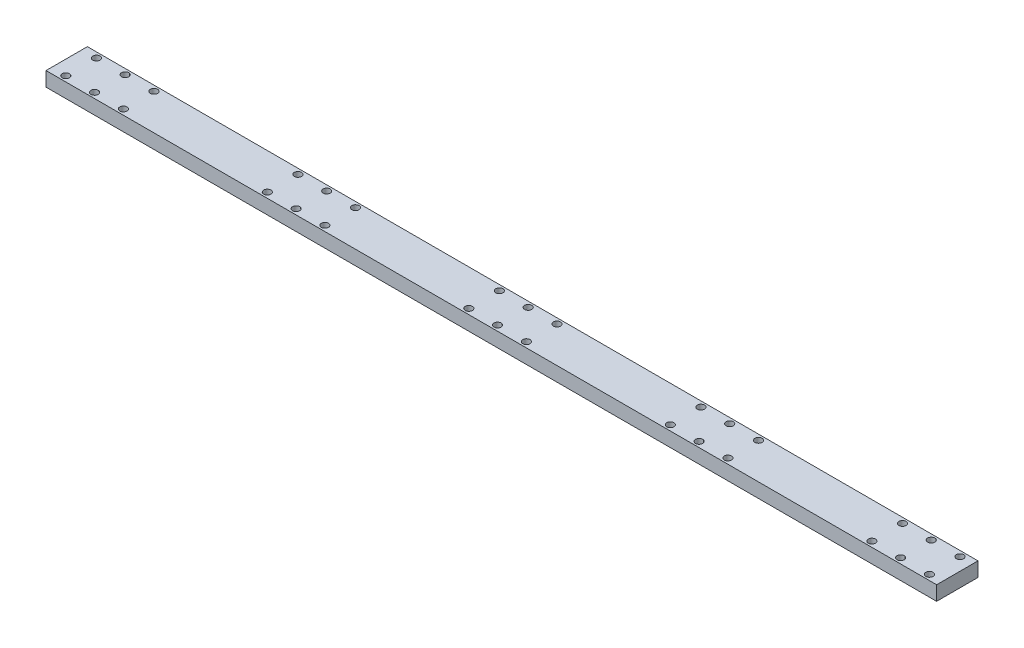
ISO-10303-21;
HEADER;
FILE_DESCRIPTION(('STEP AP214'),'2;1');
FILE_NAME('part.step','',(''),(''),'','','');
FILE_SCHEMA(('AUTOMOTIVE_DESIGN { 1 0 10303 214 1 1 1 1 }'));
ENDSEC;
DATA;
#1=APPLICATION_CONTEXT('core data for automotive mechanical design processes');
#2=APPLICATION_PROTOCOL_DEFINITION('international standard','automotive_design',2000,#1);
#3=PRODUCT_CONTEXT('',#1,'mechanical');
#4=PRODUCT('Part','Part','',(#3));
#5=PRODUCT_RELATED_PRODUCT_CATEGORY('part','',(#4));
#6=PRODUCT_DEFINITION_FORMATION('','',#4);
#7=PRODUCT_DEFINITION_CONTEXT('part definition',#1,'design');
#8=PRODUCT_DEFINITION('design','',#6,#7);
#9=PRODUCT_DEFINITION_SHAPE('','',#8);
#10=(LENGTH_UNIT() NAMED_UNIT(*) SI_UNIT(.MILLI.,.METRE.));
#11=(NAMED_UNIT(*) PLANE_ANGLE_UNIT() SI_UNIT($,.RADIAN.));
#12=(NAMED_UNIT(*) SI_UNIT($,.STERADIAN.) SOLID_ANGLE_UNIT());
#13=UNCERTAINTY_MEASURE_WITH_UNIT(LENGTH_MEASURE(1.E-05),#10,'distance_accuracy_value','');
#14=(GEOMETRIC_REPRESENTATION_CONTEXT(3) GLOBAL_UNCERTAINTY_ASSIGNED_CONTEXT((#13)) GLOBAL_UNIT_ASSIGNED_CONTEXT((#10,
#11,#12)) REPRESENTATION_CONTEXT('',''));
#15=CARTESIAN_POINT('',(0.,0.,0.));
#16=DIRECTION('',(0.,0.,1.));
#17=DIRECTION('',(1.,0.,0.));
#18=AXIS2_PLACEMENT_3D('',#15,#16,#17);
#19=CARTESIAN_POINT('',(0.,7.99999999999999,0.));
#20=DIRECTION('',(0.,1.,0.));
#21=DIRECTION('',(0.,0.,1.));
#22=AXIS2_PLACEMENT_3D('',#19,#20,#21);
#23=PLANE('',#22);
#24=CARTESIAN_POINT('',(451.8,7.99999999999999,6.1));
#25=DIRECTION('',(0.,1.,0.));
#26=DIRECTION('',(0.,0.,1.));
#27=AXIS2_PLACEMENT_3D('',#24,#25,#26);
#28=CIRCLE('',#27,2.);
#29=CARTESIAN_POINT('',(451.8,7.99999999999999,8.09999999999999));
#30=VERTEX_POINT('',#29);
#31=EDGE_CURVE('E279',#30,#30,#28,.T.);
#32=ORIENTED_EDGE('',*,*,#31,.F.);
#33=EDGE_LOOP('',(#32));
#34=FACE_BOUND('',#33,.T.);
#35=CARTESIAN_POINT('',(467.8,7.99999999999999,-10.9));
#36=DIRECTION('',(0.,1.,0.));
#37=DIRECTION('',(0.,0.,1.));
#38=AXIS2_PLACEMENT_3D('',#35,#36,#37);
#39=CIRCLE('',#38,2.);
#40=CARTESIAN_POINT('',(467.8,7.99999999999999,-8.90000000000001));
#41=VERTEX_POINT('',#40);
#42=EDGE_CURVE('E267',#41,#41,#39,.T.);
#43=ORIENTED_EDGE('',*,*,#42,.F.);
#44=EDGE_LOOP('',(#43));
#45=FACE_BOUND('',#44,.T.);
#46=CARTESIAN_POINT('',(435.8,7.99999999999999,-10.9));
#47=DIRECTION('',(0.,1.,0.));
#48=DIRECTION('',(0.,0.,1.));
#49=AXIS2_PLACEMENT_3D('',#46,#47,#48);
#50=CIRCLE('',#49,2.);
#51=CARTESIAN_POINT('',(435.8,7.99999999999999,-8.90000000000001));
#52=VERTEX_POINT('',#51);
#53=EDGE_CURVE('E255',#52,#52,#50,.T.);
#54=ORIENTED_EDGE('',*,*,#53,.F.);
#55=EDGE_LOOP('',(#54));
#56=FACE_BOUND('',#55,.T.);
#57=CARTESIAN_POINT('',(339.8,7.99999999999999,6.1));
#58=DIRECTION('',(0.,1.,0.));
#59=DIRECTION('',(0.,0.,1.));
#60=AXIS2_PLACEMENT_3D('',#57,#58,#59);
#61=CIRCLE('',#60,2.);
#62=CARTESIAN_POINT('',(339.8,7.99999999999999,8.09999999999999));
#63=VERTEX_POINT('',#62);
#64=EDGE_CURVE('E243',#63,#63,#61,.T.);
#65=ORIENTED_EDGE('',*,*,#64,.F.);
#66=EDGE_LOOP('',(#65));
#67=FACE_BOUND('',#66,.T.);
#68=CARTESIAN_POINT('',(355.8,7.99999999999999,-10.9));
#69=DIRECTION('',(0.,1.,0.));
#70=DIRECTION('',(0.,0.,1.));
#71=AXIS2_PLACEMENT_3D('',#68,#69,#70);
#72=CIRCLE('',#71,2.);
#73=CARTESIAN_POINT('',(355.8,7.99999999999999,-8.90000000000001));
#74=VERTEX_POINT('',#73);
#75=EDGE_CURVE('E231',#74,#74,#72,.T.);
#76=ORIENTED_EDGE('',*,*,#75,.F.);
#77=EDGE_LOOP('',(#76));
#78=FACE_BOUND('',#77,.T.);
#79=CARTESIAN_POINT('',(323.8,7.99999999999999,-10.9));
#80=DIRECTION('',(0.,1.,0.));
#81=DIRECTION('',(0.,0.,1.));
#82=AXIS2_PLACEMENT_3D('',#79,#80,#81);
#83=CIRCLE('',#82,2.);
#84=CARTESIAN_POINT('',(323.8,7.99999999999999,-8.90000000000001));
#85=VERTEX_POINT('',#84);
#86=EDGE_CURVE('E219',#85,#85,#83,.T.);
#87=ORIENTED_EDGE('',*,*,#86,.F.);
#88=EDGE_LOOP('',(#87));
#89=FACE_BOUND('',#88,.T.);
#90=CARTESIAN_POINT('',(227.8,7.99999999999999,6.1));
#91=DIRECTION('',(0.,1.,0.));
#92=DIRECTION('',(0.,0.,1.));
#93=AXIS2_PLACEMENT_3D('',#90,#91,#92);
#94=CIRCLE('',#93,2.);
#95=CARTESIAN_POINT('',(227.8,7.99999999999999,8.09999999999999));
#96=VERTEX_POINT('',#95);
#97=EDGE_CURVE('E207',#96,#96,#94,.T.);
#98=ORIENTED_EDGE('',*,*,#97,.F.);
#99=EDGE_LOOP('',(#98));
#100=FACE_BOUND('',#99,.T.);
#101=CARTESIAN_POINT('',(243.8,7.99999999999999,-10.9));
#102=DIRECTION('',(0.,1.,0.));
#103=DIRECTION('',(0.,0.,1.));
#104=AXIS2_PLACEMENT_3D('',#101,#102,#103);
#105=CIRCLE('',#104,2.);
#106=CARTESIAN_POINT('',(243.8,7.99999999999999,-8.90000000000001));
#107=VERTEX_POINT('',#106);
#108=EDGE_CURVE('E195',#107,#107,#105,.T.);
#109=ORIENTED_EDGE('',*,*,#108,.F.);
#110=EDGE_LOOP('',(#109));
#111=FACE_BOUND('',#110,.T.);
#112=CARTESIAN_POINT('',(211.8,7.99999999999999,-10.9));
#113=DIRECTION('',(0.,1.,0.));
#114=DIRECTION('',(0.,0.,1.));
#115=AXIS2_PLACEMENT_3D('',#112,#113,#114);
#116=CIRCLE('',#115,2.);
#117=CARTESIAN_POINT('',(211.8,7.99999999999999,-8.90000000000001));
#118=VERTEX_POINT('',#117);
#119=EDGE_CURVE('E183',#118,#118,#116,.T.);
#120=ORIENTED_EDGE('',*,*,#119,.F.);
#121=EDGE_LOOP('',(#120));
#122=FACE_BOUND('',#121,.T.);
#123=CARTESIAN_POINT('',(115.8,7.99999999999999,6.1));
#124=DIRECTION('',(0.,1.,0.));
#125=DIRECTION('',(0.,0.,1.));
#126=AXIS2_PLACEMENT_3D('',#123,#124,#125);
#127=CIRCLE('',#126,2.);
#128=CARTESIAN_POINT('',(115.8,7.99999999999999,8.09999999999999));
#129=VERTEX_POINT('',#128);
#130=EDGE_CURVE('E171',#129,#129,#127,.T.);
#131=ORIENTED_EDGE('',*,*,#130,.F.);
#132=EDGE_LOOP('',(#131));
#133=FACE_BOUND('',#132,.T.);
#134=CARTESIAN_POINT('',(131.8,7.99999999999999,-10.9));
#135=DIRECTION('',(0.,1.,0.));
#136=DIRECTION('',(0.,0.,1.));
#137=AXIS2_PLACEMENT_3D('',#134,#135,#136);
#138=CIRCLE('',#137,2.);
#139=CARTESIAN_POINT('',(131.8,7.99999999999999,-8.90000000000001));
#140=VERTEX_POINT('',#139);
#141=EDGE_CURVE('E159',#140,#140,#138,.T.);
#142=ORIENTED_EDGE('',*,*,#141,.F.);
#143=EDGE_LOOP('',(#142));
#144=FACE_BOUND('',#143,.T.);
#145=CARTESIAN_POINT('',(99.8,7.99999999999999,-10.9));
#146=DIRECTION('',(0.,1.,0.));
#147=DIRECTION('',(0.,0.,1.));
#148=AXIS2_PLACEMENT_3D('',#145,#146,#147);
#149=CIRCLE('',#148,2.);
#150=CARTESIAN_POINT('',(99.8,7.99999999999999,-8.90000000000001));
#151=VERTEX_POINT('',#150);
#152=EDGE_CURVE('E147',#151,#151,#149,.T.);
#153=ORIENTED_EDGE('',*,*,#152,.F.);
#154=EDGE_LOOP('',(#153));
#155=FACE_BOUND('',#154,.T.);
#156=CARTESIAN_POINT('',(3.80000000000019,7.99999999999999,6.1));
#157=DIRECTION('',(0.,1.,0.));
#158=DIRECTION('',(0.,0.,1.));
#159=AXIS2_PLACEMENT_3D('',#156,#157,#158);
#160=CIRCLE('',#159,2.);
#161=CARTESIAN_POINT('',(3.80000000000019,7.99999999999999,8.1));
#162=VERTEX_POINT('',#161);
#163=EDGE_CURVE('E135',#162,#162,#160,.T.);
#164=ORIENTED_EDGE('',*,*,#163,.F.);
#165=EDGE_LOOP('',(#164));
#166=FACE_BOUND('',#165,.T.);
#167=CARTESIAN_POINT('',(19.8,7.99999999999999,-10.9));
#168=DIRECTION('',(0.,1.,0.));
#169=DIRECTION('',(0.,0.,1.));
#170=AXIS2_PLACEMENT_3D('',#167,#168,#169);
#171=CIRCLE('',#170,2.);
#172=CARTESIAN_POINT('',(19.8,7.99999999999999,-8.9));
#173=VERTEX_POINT('',#172);
#174=EDGE_CURVE('E123',#173,#173,#171,.T.);
#175=ORIENTED_EDGE('',*,*,#174,.F.);
#176=EDGE_LOOP('',(#175));
#177=FACE_BOUND('',#176,.T.);
#178=CARTESIAN_POINT('',(-12.2,7.99999999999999,-10.9));
#179=DIRECTION('',(0.,1.,0.));
#180=DIRECTION('',(0.,0.,1.));
#181=AXIS2_PLACEMENT_3D('',#178,#179,#180);
#182=CIRCLE('',#181,2.);
#183=CARTESIAN_POINT('',(-12.2,7.99999999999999,-8.9));
#184=VERTEX_POINT('',#183);
#185=EDGE_CURVE('E102',#184,#184,#182,.T.);
#186=ORIENTED_EDGE('',*,*,#185,.F.);
#187=EDGE_LOOP('',(#186));
#188=FACE_BOUND('',#187,.T.);
#189=DIRECTION('',(0.,0.,1.));
#190=VECTOR('',#189,1.);
#191=CARTESIAN_POINT('',(-20.2,7.99999999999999,-13.9));
#192=LINE('',#191,#190);
#193=CARTESIAN_POINT('',(-20.2,7.99999999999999,-13.9));
#194=VERTEX_POINT('',#193);
#195=CARTESIAN_POINT('',(-20.2,7.99999999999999,9.1));
#196=VERTEX_POINT('',#195);
#197=EDGE_CURVE('E87',#194,#196,#192,.T.);
#198=ORIENTED_EDGE('',*,*,#197,.T.);
#199=DIRECTION('',(1.,0.,0.));
#200=VECTOR('',#199,1.);
#201=CARTESIAN_POINT('',(-20.2,7.99999999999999,9.1));
#202=LINE('',#201,#200);
#203=CARTESIAN_POINT('',(474.8,7.99999999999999,9.1));
#204=VERTEX_POINT('',#203);
#205=EDGE_CURVE('E82',#196,#204,#202,.T.);
#206=ORIENTED_EDGE('',*,*,#205,.T.);
#207=DIRECTION('',(0.,0.,-1.));
#208=VECTOR('',#207,1.);
#209=CARTESIAN_POINT('',(474.8,7.99999999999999,-13.9));
#210=LINE('',#209,#208);
#211=CARTESIAN_POINT('',(474.8,7.99999999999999,-13.9));
#212=VERTEX_POINT('',#211);
#213=EDGE_CURVE('E85',#204,#212,#210,.T.);
#214=ORIENTED_EDGE('',*,*,#213,.T.);
#215=DIRECTION('',(-1.,0.,0.));
#216=VECTOR('',#215,1.);
#217=CARTESIAN_POINT('',(-20.2,7.99999999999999,-13.9));
#218=LINE('',#217,#216);
#219=EDGE_CURVE('E52',#212,#194,#218,.T.);
#220=ORIENTED_EDGE('',*,*,#219,.T.);
#221=EDGE_LOOP('',(#198,#206,#214,#220));
#222=FACE_BOUND('',#221,.T.);
#223=CARTESIAN_POINT('',(3.80000000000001,7.99999999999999,-10.9));
#224=DIRECTION('',(0.,1.,0.));
#225=DIRECTION('',(0.,0.,1.));
#226=AXIS2_PLACEMENT_3D('',#223,#224,#225);
#227=CIRCLE('',#226,2.);
#228=CARTESIAN_POINT('',(3.80000000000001,7.99999999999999,-8.9));
#229=VERTEX_POINT('',#228);
#230=EDGE_CURVE('E117',#229,#229,#227,.T.);
#231=ORIENTED_EDGE('',*,*,#230,.F.);
#232=EDGE_LOOP('',(#231));
#233=FACE_BOUND('',#232,.T.);
#234=CARTESIAN_POINT('',(-12.1999999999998,7.99999999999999,6.1));
#235=DIRECTION('',(0.,1.,0.));
#236=DIRECTION('',(0.,0.,1.));
#237=AXIS2_PLACEMENT_3D('',#234,#235,#236);
#238=CIRCLE('',#237,2.);
#239=CARTESIAN_POINT('',(-12.1999999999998,7.99999999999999,8.1));
#240=VERTEX_POINT('',#239);
#241=EDGE_CURVE('E129',#240,#240,#238,.T.);
#242=ORIENTED_EDGE('',*,*,#241,.F.);
#243=EDGE_LOOP('',(#242));
#244=FACE_BOUND('',#243,.T.);
#245=CARTESIAN_POINT('',(19.8000000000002,7.99999999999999,6.1));
#246=DIRECTION('',(0.,1.,0.));
#247=DIRECTION('',(0.,0.,1.));
#248=AXIS2_PLACEMENT_3D('',#245,#246,#247);
#249=CIRCLE('',#248,2.);
#250=CARTESIAN_POINT('',(19.8000000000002,7.99999999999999,8.1));
#251=VERTEX_POINT('',#250);
#252=EDGE_CURVE('E141',#251,#251,#249,.T.);
#253=ORIENTED_EDGE('',*,*,#252,.F.);
#254=EDGE_LOOP('',(#253));
#255=FACE_BOUND('',#254,.T.);
#256=CARTESIAN_POINT('',(115.8,7.99999999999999,-10.9));
#257=DIRECTION('',(0.,1.,0.));
#258=DIRECTION('',(0.,0.,1.));
#259=AXIS2_PLACEMENT_3D('',#256,#257,#258);
#260=CIRCLE('',#259,2.);
#261=CARTESIAN_POINT('',(115.8,7.99999999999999,-8.90000000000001));
#262=VERTEX_POINT('',#261);
#263=EDGE_CURVE('E153',#262,#262,#260,.T.);
#264=ORIENTED_EDGE('',*,*,#263,.F.);
#265=EDGE_LOOP('',(#264));
#266=FACE_BOUND('',#265,.T.);
#267=CARTESIAN_POINT('',(99.8000000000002,7.99999999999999,6.1));
#268=DIRECTION('',(0.,1.,0.));
#269=DIRECTION('',(0.,0.,1.));
#270=AXIS2_PLACEMENT_3D('',#267,#268,#269);
#271=CIRCLE('',#270,2.);
#272=CARTESIAN_POINT('',(99.8000000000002,7.99999999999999,8.09999999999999));
#273=VERTEX_POINT('',#272);
#274=EDGE_CURVE('E165',#273,#273,#271,.T.);
#275=ORIENTED_EDGE('',*,*,#274,.F.);
#276=EDGE_LOOP('',(#275));
#277=FACE_BOUND('',#276,.T.);
#278=CARTESIAN_POINT('',(131.8,7.99999999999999,6.1));
#279=DIRECTION('',(0.,1.,0.));
#280=DIRECTION('',(0.,0.,1.));
#281=AXIS2_PLACEMENT_3D('',#278,#279,#280);
#282=CIRCLE('',#281,2.);
#283=CARTESIAN_POINT('',(131.8,7.99999999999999,8.09999999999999));
#284=VERTEX_POINT('',#283);
#285=EDGE_CURVE('E177',#284,#284,#282,.T.);
#286=ORIENTED_EDGE('',*,*,#285,.F.);
#287=EDGE_LOOP('',(#286));
#288=FACE_BOUND('',#287,.T.);
#289=CARTESIAN_POINT('',(227.8,7.99999999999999,-10.9));
#290=DIRECTION('',(0.,1.,0.));
#291=DIRECTION('',(0.,0.,1.));
#292=AXIS2_PLACEMENT_3D('',#289,#290,#291);
#293=CIRCLE('',#292,2.);
#294=CARTESIAN_POINT('',(227.8,7.99999999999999,-8.90000000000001));
#295=VERTEX_POINT('',#294);
#296=EDGE_CURVE('E189',#295,#295,#293,.T.);
#297=ORIENTED_EDGE('',*,*,#296,.F.);
#298=EDGE_LOOP('',(#297));
#299=FACE_BOUND('',#298,.T.);
#300=CARTESIAN_POINT('',(211.8,7.99999999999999,6.1));
#301=DIRECTION('',(0.,1.,0.));
#302=DIRECTION('',(0.,0.,1.));
#303=AXIS2_PLACEMENT_3D('',#300,#301,#302);
#304=CIRCLE('',#303,2.);
#305=CARTESIAN_POINT('',(211.8,7.99999999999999,8.09999999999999));
#306=VERTEX_POINT('',#305);
#307=EDGE_CURVE('E201',#306,#306,#304,.T.);
#308=ORIENTED_EDGE('',*,*,#307,.F.);
#309=EDGE_LOOP('',(#308));
#310=FACE_BOUND('',#309,.T.);
#311=CARTESIAN_POINT('',(243.8,7.99999999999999,6.1));
#312=DIRECTION('',(0.,1.,0.));
#313=DIRECTION('',(0.,0.,1.));
#314=AXIS2_PLACEMENT_3D('',#311,#312,#313);
#315=CIRCLE('',#314,2.);
#316=CARTESIAN_POINT('',(243.8,7.99999999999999,8.09999999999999));
#317=VERTEX_POINT('',#316);
#318=EDGE_CURVE('E213',#317,#317,#315,.T.);
#319=ORIENTED_EDGE('',*,*,#318,.F.);
#320=EDGE_LOOP('',(#319));
#321=FACE_BOUND('',#320,.T.);
#322=CARTESIAN_POINT('',(339.8,7.99999999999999,-10.9));
#323=DIRECTION('',(0.,1.,0.));
#324=DIRECTION('',(0.,0.,1.));
#325=AXIS2_PLACEMENT_3D('',#322,#323,#324);
#326=CIRCLE('',#325,2.);
#327=CARTESIAN_POINT('',(339.8,7.99999999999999,-8.90000000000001));
#328=VERTEX_POINT('',#327);
#329=EDGE_CURVE('E225',#328,#328,#326,.T.);
#330=ORIENTED_EDGE('',*,*,#329,.F.);
#331=EDGE_LOOP('',(#330));
#332=FACE_BOUND('',#331,.T.);
#333=CARTESIAN_POINT('',(323.8,7.99999999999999,6.1));
#334=DIRECTION('',(0.,1.,0.));
#335=DIRECTION('',(0.,0.,1.));
#336=AXIS2_PLACEMENT_3D('',#333,#334,#335);
#337=CIRCLE('',#336,2.);
#338=CARTESIAN_POINT('',(323.8,7.99999999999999,8.09999999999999));
#339=VERTEX_POINT('',#338);
#340=EDGE_CURVE('E237',#339,#339,#337,.T.);
#341=ORIENTED_EDGE('',*,*,#340,.F.);
#342=EDGE_LOOP('',(#341));
#343=FACE_BOUND('',#342,.T.);
#344=CARTESIAN_POINT('',(355.8,7.99999999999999,6.1));
#345=DIRECTION('',(0.,1.,0.));
#346=DIRECTION('',(0.,0.,1.));
#347=AXIS2_PLACEMENT_3D('',#344,#345,#346);
#348=CIRCLE('',#347,2.);
#349=CARTESIAN_POINT('',(355.8,7.99999999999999,8.09999999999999));
#350=VERTEX_POINT('',#349);
#351=EDGE_CURVE('E249',#350,#350,#348,.T.);
#352=ORIENTED_EDGE('',*,*,#351,.F.);
#353=EDGE_LOOP('',(#352));
#354=FACE_BOUND('',#353,.T.);
#355=CARTESIAN_POINT('',(451.8,7.99999999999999,-10.9));
#356=DIRECTION('',(0.,1.,0.));
#357=DIRECTION('',(0.,0.,1.));
#358=AXIS2_PLACEMENT_3D('',#355,#356,#357);
#359=CIRCLE('',#358,2.);
#360=CARTESIAN_POINT('',(451.8,7.99999999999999,-8.90000000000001));
#361=VERTEX_POINT('',#360);
#362=EDGE_CURVE('E261',#361,#361,#359,.T.);
#363=ORIENTED_EDGE('',*,*,#362,.F.);
#364=EDGE_LOOP('',(#363));
#365=FACE_BOUND('',#364,.T.);
#366=CARTESIAN_POINT('',(435.8,7.99999999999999,6.1));
#367=DIRECTION('',(0.,1.,0.));
#368=DIRECTION('',(0.,0.,1.));
#369=AXIS2_PLACEMENT_3D('',#366,#367,#368);
#370=CIRCLE('',#369,2.);
#371=CARTESIAN_POINT('',(435.8,7.99999999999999,8.09999999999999));
#372=VERTEX_POINT('',#371);
#373=EDGE_CURVE('E273',#372,#372,#370,.T.);
#374=ORIENTED_EDGE('',*,*,#373,.F.);
#375=EDGE_LOOP('',(#374));
#376=FACE_BOUND('',#375,.T.);
#377=CARTESIAN_POINT('',(467.8,7.99999999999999,6.1));
#378=DIRECTION('',(0.,1.,0.));
#379=DIRECTION('',(0.,0.,1.));
#380=AXIS2_PLACEMENT_3D('',#377,#378,#379);
#381=CIRCLE('',#380,2.);
#382=CARTESIAN_POINT('',(467.8,7.99999999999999,8.09999999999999));
#383=VERTEX_POINT('',#382);
#384=EDGE_CURVE('E285',#383,#383,#381,.T.);
#385=ORIENTED_EDGE('',*,*,#384,.F.);
#386=EDGE_LOOP('',(#385));
#387=FACE_BOUND('',#386,.T.);
#388=ADVANCED_FACE('F35',(#34,#45,#56,#67,#78,#89,#100,#111,#122,#133,#144,#155,#166,#177,#188,
#222,#233,#244,#255,#266,#277,#288,#299,#310,#321,#332,#343,#354,#365,#376,#387),#23,.T.);
#389=CARTESIAN_POINT('',(0.,0.,0.));
#390=DIRECTION('',(0.,1.,0.));
#391=DIRECTION('',(0.,0.,1.));
#392=AXIS2_PLACEMENT_3D('',#389,#390,#391);
#393=PLANE('',#392);
#394=DIRECTION('',(0.,0.,1.));
#395=VECTOR('',#394,1.);
#396=CARTESIAN_POINT('',(-20.2,0.,-13.9));
#397=LINE('',#396,#395);
#398=CARTESIAN_POINT('',(-20.2,0.,-13.9));
#399=VERTEX_POINT('',#398);
#400=CARTESIAN_POINT('',(-20.2,0.,9.1));
#401=VERTEX_POINT('',#400);
#402=EDGE_CURVE('E99',#399,#401,#397,.T.);
#403=ORIENTED_EDGE('',*,*,#402,.F.);
#404=DIRECTION('',(-1.,0.,0.));
#405=VECTOR('',#404,1.);
#406=CARTESIAN_POINT('',(-20.2,0.,-13.9));
#407=LINE('',#406,#405);
#408=CARTESIAN_POINT('',(474.8,0.,-13.9));
#409=VERTEX_POINT('',#408);
#410=EDGE_CURVE('E75',#409,#399,#407,.T.);
#411=ORIENTED_EDGE('',*,*,#410,.F.);
#412=DIRECTION('',(0.,0.,-1.));
#413=VECTOR('',#412,1.);
#414=CARTESIAN_POINT('',(474.8,0.,-13.9));
#415=LINE('',#414,#413);
#416=CARTESIAN_POINT('',(474.8,0.,9.1));
#417=VERTEX_POINT('',#416);
#418=EDGE_CURVE('E69',#417,#409,#415,.T.);
#419=ORIENTED_EDGE('',*,*,#418,.F.);
#420=DIRECTION('',(1.,0.,0.));
#421=VECTOR('',#420,1.);
#422=CARTESIAN_POINT('',(-20.2,0.,9.1));
#423=LINE('',#422,#421);
#424=EDGE_CURVE('E91',#401,#417,#423,.T.);
#425=ORIENTED_EDGE('',*,*,#424,.F.);
#426=EDGE_LOOP('',(#403,#411,#419,#425));
#427=FACE_BOUND('',#426,.T.);
#428=CARTESIAN_POINT('',(-12.2,0.,-10.9));
#429=DIRECTION('',(0.,1.,0.));
#430=DIRECTION('',(0.,0.,1.));
#431=AXIS2_PLACEMENT_3D('',#428,#429,#430);
#432=CIRCLE('',#431,2.);
#433=CARTESIAN_POINT('',(-12.2,0.,-8.9));
#434=VERTEX_POINT('',#433);
#435=EDGE_CURVE('E114',#434,#434,#432,.T.);
#436=ORIENTED_EDGE('',*,*,#435,.T.);
#437=EDGE_LOOP('',(#436));
#438=FACE_BOUND('',#437,.T.);
#439=CARTESIAN_POINT('',(3.80000000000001,0.,-10.9));
#440=DIRECTION('',(0.,1.,0.));
#441=DIRECTION('',(0.,0.,1.));
#442=AXIS2_PLACEMENT_3D('',#439,#440,#441);
#443=CIRCLE('',#442,2.);
#444=CARTESIAN_POINT('',(3.80000000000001,0.,-8.9));
#445=VERTEX_POINT('',#444);
#446=EDGE_CURVE('E120',#445,#445,#443,.T.);
#447=ORIENTED_EDGE('',*,*,#446,.T.);
#448=EDGE_LOOP('',(#447));
#449=FACE_BOUND('',#448,.T.);
#450=CARTESIAN_POINT('',(19.8,0.,-10.9));
#451=DIRECTION('',(0.,1.,0.));
#452=DIRECTION('',(0.,0.,1.));
#453=AXIS2_PLACEMENT_3D('',#450,#451,#452);
#454=CIRCLE('',#453,2.);
#455=CARTESIAN_POINT('',(19.8,0.,-8.9));
#456=VERTEX_POINT('',#455);
#457=EDGE_CURVE('E126',#456,#456,#454,.T.);
#458=ORIENTED_EDGE('',*,*,#457,.T.);
#459=EDGE_LOOP('',(#458));
#460=FACE_BOUND('',#459,.T.);
#461=CARTESIAN_POINT('',(-12.1999999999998,0.,6.1));
#462=DIRECTION('',(0.,1.,0.));
#463=DIRECTION('',(0.,0.,1.));
#464=AXIS2_PLACEMENT_3D('',#461,#462,#463);
#465=CIRCLE('',#464,2.);
#466=CARTESIAN_POINT('',(-12.1999999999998,0.,8.1));
#467=VERTEX_POINT('',#466);
#468=EDGE_CURVE('E132',#467,#467,#465,.T.);
#469=ORIENTED_EDGE('',*,*,#468,.T.);
#470=EDGE_LOOP('',(#469));
#471=FACE_BOUND('',#470,.T.);
#472=CARTESIAN_POINT('',(3.80000000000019,0.,6.1));
#473=DIRECTION('',(0.,1.,0.));
#474=DIRECTION('',(0.,0.,1.));
#475=AXIS2_PLACEMENT_3D('',#472,#473,#474);
#476=CIRCLE('',#475,2.);
#477=CARTESIAN_POINT('',(3.80000000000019,0.,8.1));
#478=VERTEX_POINT('',#477);
#479=EDGE_CURVE('E138',#478,#478,#476,.T.);
#480=ORIENTED_EDGE('',*,*,#479,.T.);
#481=EDGE_LOOP('',(#480));
#482=FACE_BOUND('',#481,.T.);
#483=CARTESIAN_POINT('',(19.8000000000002,0.,6.1));
#484=DIRECTION('',(0.,1.,0.));
#485=DIRECTION('',(0.,0.,1.));
#486=AXIS2_PLACEMENT_3D('',#483,#484,#485);
#487=CIRCLE('',#486,2.);
#488=CARTESIAN_POINT('',(19.8000000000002,0.,8.1));
#489=VERTEX_POINT('',#488);
#490=EDGE_CURVE('E144',#489,#489,#487,.T.);
#491=ORIENTED_EDGE('',*,*,#490,.T.);
#492=EDGE_LOOP('',(#491));
#493=FACE_BOUND('',#492,.T.);
#494=CARTESIAN_POINT('',(99.8,0.,-10.9));
#495=DIRECTION('',(0.,1.,0.));
#496=DIRECTION('',(0.,0.,1.));
#497=AXIS2_PLACEMENT_3D('',#494,#495,#496);
#498=CIRCLE('',#497,2.);
#499=CARTESIAN_POINT('',(99.8,0.,-8.90000000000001));
#500=VERTEX_POINT('',#499);
#501=EDGE_CURVE('E150',#500,#500,#498,.T.);
#502=ORIENTED_EDGE('',*,*,#501,.T.);
#503=EDGE_LOOP('',(#502));
#504=FACE_BOUND('',#503,.T.);
#505=CARTESIAN_POINT('',(115.8,0.,-10.9));
#506=DIRECTION('',(0.,1.,0.));
#507=DIRECTION('',(0.,0.,1.));
#508=AXIS2_PLACEMENT_3D('',#505,#506,#507);
#509=CIRCLE('',#508,2.);
#510=CARTESIAN_POINT('',(115.8,0.,-8.90000000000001));
#511=VERTEX_POINT('',#510);
#512=EDGE_CURVE('E156',#511,#511,#509,.T.);
#513=ORIENTED_EDGE('',*,*,#512,.T.);
#514=EDGE_LOOP('',(#513));
#515=FACE_BOUND('',#514,.T.);
#516=CARTESIAN_POINT('',(131.8,0.,-10.9));
#517=DIRECTION('',(0.,1.,0.));
#518=DIRECTION('',(0.,0.,1.));
#519=AXIS2_PLACEMENT_3D('',#516,#517,#518);
#520=CIRCLE('',#519,2.);
#521=CARTESIAN_POINT('',(131.8,0.,-8.90000000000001));
#522=VERTEX_POINT('',#521);
#523=EDGE_CURVE('E162',#522,#522,#520,.T.);
#524=ORIENTED_EDGE('',*,*,#523,.T.);
#525=EDGE_LOOP('',(#524));
#526=FACE_BOUND('',#525,.T.);
#527=CARTESIAN_POINT('',(99.8000000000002,0.,6.1));
#528=DIRECTION('',(0.,1.,0.));
#529=DIRECTION('',(0.,0.,1.));
#530=AXIS2_PLACEMENT_3D('',#527,#528,#529);
#531=CIRCLE('',#530,2.);
#532=CARTESIAN_POINT('',(99.8000000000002,0.,8.09999999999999));
#533=VERTEX_POINT('',#532);
#534=EDGE_CURVE('E168',#533,#533,#531,.T.);
#535=ORIENTED_EDGE('',*,*,#534,.T.);
#536=EDGE_LOOP('',(#535));
#537=FACE_BOUND('',#536,.T.);
#538=CARTESIAN_POINT('',(115.8,0.,6.1));
#539=DIRECTION('',(0.,1.,0.));
#540=DIRECTION('',(0.,0.,1.));
#541=AXIS2_PLACEMENT_3D('',#538,#539,#540);
#542=CIRCLE('',#541,2.);
#543=CARTESIAN_POINT('',(115.8,0.,8.09999999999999));
#544=VERTEX_POINT('',#543);
#545=EDGE_CURVE('E174',#544,#544,#542,.T.);
#546=ORIENTED_EDGE('',*,*,#545,.T.);
#547=EDGE_LOOP('',(#546));
#548=FACE_BOUND('',#547,.T.);
#549=CARTESIAN_POINT('',(131.8,0.,6.1));
#550=DIRECTION('',(0.,1.,0.));
#551=DIRECTION('',(0.,0.,1.));
#552=AXIS2_PLACEMENT_3D('',#549,#550,#551);
#553=CIRCLE('',#552,2.);
#554=CARTESIAN_POINT('',(131.8,0.,8.09999999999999));
#555=VERTEX_POINT('',#554);
#556=EDGE_CURVE('E180',#555,#555,#553,.T.);
#557=ORIENTED_EDGE('',*,*,#556,.T.);
#558=EDGE_LOOP('',(#557));
#559=FACE_BOUND('',#558,.T.);
#560=CARTESIAN_POINT('',(211.8,0.,-10.9));
#561=DIRECTION('',(0.,1.,0.));
#562=DIRECTION('',(0.,0.,1.));
#563=AXIS2_PLACEMENT_3D('',#560,#561,#562);
#564=CIRCLE('',#563,2.);
#565=CARTESIAN_POINT('',(211.8,0.,-8.90000000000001));
#566=VERTEX_POINT('',#565);
#567=EDGE_CURVE('E186',#566,#566,#564,.T.);
#568=ORIENTED_EDGE('',*,*,#567,.T.);
#569=EDGE_LOOP('',(#568));
#570=FACE_BOUND('',#569,.T.);
#571=CARTESIAN_POINT('',(227.8,0.,-10.9));
#572=DIRECTION('',(0.,1.,0.));
#573=DIRECTION('',(0.,0.,1.));
#574=AXIS2_PLACEMENT_3D('',#571,#572,#573);
#575=CIRCLE('',#574,2.);
#576=CARTESIAN_POINT('',(227.8,0.,-8.90000000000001));
#577=VERTEX_POINT('',#576);
#578=EDGE_CURVE('E192',#577,#577,#575,.T.);
#579=ORIENTED_EDGE('',*,*,#578,.T.);
#580=EDGE_LOOP('',(#579));
#581=FACE_BOUND('',#580,.T.);
#582=CARTESIAN_POINT('',(243.8,0.,-10.9));
#583=DIRECTION('',(0.,1.,0.));
#584=DIRECTION('',(0.,0.,1.));
#585=AXIS2_PLACEMENT_3D('',#582,#583,#584);
#586=CIRCLE('',#585,2.);
#587=CARTESIAN_POINT('',(243.8,0.,-8.90000000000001));
#588=VERTEX_POINT('',#587);
#589=EDGE_CURVE('E198',#588,#588,#586,.T.);
#590=ORIENTED_EDGE('',*,*,#589,.T.);
#591=EDGE_LOOP('',(#590));
#592=FACE_BOUND('',#591,.T.);
#593=CARTESIAN_POINT('',(211.8,0.,6.1));
#594=DIRECTION('',(0.,1.,0.));
#595=DIRECTION('',(0.,0.,1.));
#596=AXIS2_PLACEMENT_3D('',#593,#594,#595);
#597=CIRCLE('',#596,2.);
#598=CARTESIAN_POINT('',(211.8,0.,8.09999999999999));
#599=VERTEX_POINT('',#598);
#600=EDGE_CURVE('E204',#599,#599,#597,.T.);
#601=ORIENTED_EDGE('',*,*,#600,.T.);
#602=EDGE_LOOP('',(#601));
#603=FACE_BOUND('',#602,.T.);
#604=CARTESIAN_POINT('',(227.8,0.,6.1));
#605=DIRECTION('',(0.,1.,0.));
#606=DIRECTION('',(0.,0.,1.));
#607=AXIS2_PLACEMENT_3D('',#604,#605,#606);
#608=CIRCLE('',#607,2.);
#609=CARTESIAN_POINT('',(227.8,0.,8.09999999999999));
#610=VERTEX_POINT('',#609);
#611=EDGE_CURVE('E210',#610,#610,#608,.T.);
#612=ORIENTED_EDGE('',*,*,#611,.T.);
#613=EDGE_LOOP('',(#612));
#614=FACE_BOUND('',#613,.T.);
#615=CARTESIAN_POINT('',(243.8,0.,6.1));
#616=DIRECTION('',(0.,1.,0.));
#617=DIRECTION('',(0.,0.,1.));
#618=AXIS2_PLACEMENT_3D('',#615,#616,#617);
#619=CIRCLE('',#618,2.);
#620=CARTESIAN_POINT('',(243.8,0.,8.09999999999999));
#621=VERTEX_POINT('',#620);
#622=EDGE_CURVE('E216',#621,#621,#619,.T.);
#623=ORIENTED_EDGE('',*,*,#622,.T.);
#624=EDGE_LOOP('',(#623));
#625=FACE_BOUND('',#624,.T.);
#626=CARTESIAN_POINT('',(323.8,0.,-10.9));
#627=DIRECTION('',(0.,1.,0.));
#628=DIRECTION('',(0.,0.,1.));
#629=AXIS2_PLACEMENT_3D('',#626,#627,#628);
#630=CIRCLE('',#629,2.);
#631=CARTESIAN_POINT('',(323.8,0.,-8.90000000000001));
#632=VERTEX_POINT('',#631);
#633=EDGE_CURVE('E222',#632,#632,#630,.T.);
#634=ORIENTED_EDGE('',*,*,#633,.T.);
#635=EDGE_LOOP('',(#634));
#636=FACE_BOUND('',#635,.T.);
#637=CARTESIAN_POINT('',(339.8,0.,-10.9));
#638=DIRECTION('',(0.,1.,0.));
#639=DIRECTION('',(0.,0.,1.));
#640=AXIS2_PLACEMENT_3D('',#637,#638,#639);
#641=CIRCLE('',#640,2.);
#642=CARTESIAN_POINT('',(339.8,0.,-8.90000000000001));
#643=VERTEX_POINT('',#642);
#644=EDGE_CURVE('E228',#643,#643,#641,.T.);
#645=ORIENTED_EDGE('',*,*,#644,.T.);
#646=EDGE_LOOP('',(#645));
#647=FACE_BOUND('',#646,.T.);
#648=CARTESIAN_POINT('',(355.8,0.,-10.9));
#649=DIRECTION('',(0.,1.,0.));
#650=DIRECTION('',(0.,0.,1.));
#651=AXIS2_PLACEMENT_3D('',#648,#649,#650);
#652=CIRCLE('',#651,2.);
#653=CARTESIAN_POINT('',(355.8,0.,-8.90000000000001));
#654=VERTEX_POINT('',#653);
#655=EDGE_CURVE('E234',#654,#654,#652,.T.);
#656=ORIENTED_EDGE('',*,*,#655,.T.);
#657=EDGE_LOOP('',(#656));
#658=FACE_BOUND('',#657,.T.);
#659=CARTESIAN_POINT('',(323.8,0.,6.1));
#660=DIRECTION('',(0.,1.,0.));
#661=DIRECTION('',(0.,0.,1.));
#662=AXIS2_PLACEMENT_3D('',#659,#660,#661);
#663=CIRCLE('',#662,2.);
#664=CARTESIAN_POINT('',(323.8,0.,8.09999999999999));
#665=VERTEX_POINT('',#664);
#666=EDGE_CURVE('E240',#665,#665,#663,.T.);
#667=ORIENTED_EDGE('',*,*,#666,.T.);
#668=EDGE_LOOP('',(#667));
#669=FACE_BOUND('',#668,.T.);
#670=CARTESIAN_POINT('',(339.8,0.,6.1));
#671=DIRECTION('',(0.,1.,0.));
#672=DIRECTION('',(0.,0.,1.));
#673=AXIS2_PLACEMENT_3D('',#670,#671,#672);
#674=CIRCLE('',#673,2.);
#675=CARTESIAN_POINT('',(339.8,0.,8.09999999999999));
#676=VERTEX_POINT('',#675);
#677=EDGE_CURVE('E246',#676,#676,#674,.T.);
#678=ORIENTED_EDGE('',*,*,#677,.T.);
#679=EDGE_LOOP('',(#678));
#680=FACE_BOUND('',#679,.T.);
#681=CARTESIAN_POINT('',(355.8,0.,6.1));
#682=DIRECTION('',(0.,1.,0.));
#683=DIRECTION('',(0.,0.,1.));
#684=AXIS2_PLACEMENT_3D('',#681,#682,#683);
#685=CIRCLE('',#684,2.);
#686=CARTESIAN_POINT('',(355.8,0.,8.09999999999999));
#687=VERTEX_POINT('',#686);
#688=EDGE_CURVE('E252',#687,#687,#685,.T.);
#689=ORIENTED_EDGE('',*,*,#688,.T.);
#690=EDGE_LOOP('',(#689));
#691=FACE_BOUND('',#690,.T.);
#692=CARTESIAN_POINT('',(435.8,0.,-10.9));
#693=DIRECTION('',(0.,1.,0.));
#694=DIRECTION('',(0.,0.,1.));
#695=AXIS2_PLACEMENT_3D('',#692,#693,#694);
#696=CIRCLE('',#695,2.);
#697=CARTESIAN_POINT('',(435.8,0.,-8.90000000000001));
#698=VERTEX_POINT('',#697);
#699=EDGE_CURVE('E258',#698,#698,#696,.T.);
#700=ORIENTED_EDGE('',*,*,#699,.T.);
#701=EDGE_LOOP('',(#700));
#702=FACE_BOUND('',#701,.T.);
#703=CARTESIAN_POINT('',(451.8,0.,-10.9));
#704=DIRECTION('',(0.,1.,0.));
#705=DIRECTION('',(0.,0.,1.));
#706=AXIS2_PLACEMENT_3D('',#703,#704,#705);
#707=CIRCLE('',#706,2.);
#708=CARTESIAN_POINT('',(451.8,0.,-8.90000000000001));
#709=VERTEX_POINT('',#708);
#710=EDGE_CURVE('E264',#709,#709,#707,.T.);
#711=ORIENTED_EDGE('',*,*,#710,.T.);
#712=EDGE_LOOP('',(#711));
#713=FACE_BOUND('',#712,.T.);
#714=CARTESIAN_POINT('',(467.8,0.,-10.9));
#715=DIRECTION('',(0.,1.,0.));
#716=DIRECTION('',(0.,0.,1.));
#717=AXIS2_PLACEMENT_3D('',#714,#715,#716);
#718=CIRCLE('',#717,2.);
#719=CARTESIAN_POINT('',(467.8,0.,-8.90000000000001));
#720=VERTEX_POINT('',#719);
#721=EDGE_CURVE('E270',#720,#720,#718,.T.);
#722=ORIENTED_EDGE('',*,*,#721,.T.);
#723=EDGE_LOOP('',(#722));
#724=FACE_BOUND('',#723,.T.);
#725=CARTESIAN_POINT('',(435.8,0.,6.1));
#726=DIRECTION('',(0.,1.,0.));
#727=DIRECTION('',(0.,0.,1.));
#728=AXIS2_PLACEMENT_3D('',#725,#726,#727);
#729=CIRCLE('',#728,2.);
#730=CARTESIAN_POINT('',(435.8,0.,8.09999999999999));
#731=VERTEX_POINT('',#730);
#732=EDGE_CURVE('E276',#731,#731,#729,.T.);
#733=ORIENTED_EDGE('',*,*,#732,.T.);
#734=EDGE_LOOP('',(#733));
#735=FACE_BOUND('',#734,.T.);
#736=CARTESIAN_POINT('',(451.8,0.,6.1));
#737=DIRECTION('',(0.,1.,0.));
#738=DIRECTION('',(0.,0.,1.));
#739=AXIS2_PLACEMENT_3D('',#736,#737,#738);
#740=CIRCLE('',#739,2.);
#741=CARTESIAN_POINT('',(451.8,0.,8.09999999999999));
#742=VERTEX_POINT('',#741);
#743=EDGE_CURVE('E282',#742,#742,#740,.T.);
#744=ORIENTED_EDGE('',*,*,#743,.T.);
#745=EDGE_LOOP('',(#744));
#746=FACE_BOUND('',#745,.T.);
#747=CARTESIAN_POINT('',(467.8,0.,6.1));
#748=DIRECTION('',(0.,1.,0.));
#749=DIRECTION('',(0.,0.,1.));
#750=AXIS2_PLACEMENT_3D('',#747,#748,#749);
#751=CIRCLE('',#750,2.);
#752=CARTESIAN_POINT('',(467.8,0.,8.09999999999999));
#753=VERTEX_POINT('',#752);
#754=EDGE_CURVE('E288',#753,#753,#751,.T.);
#755=ORIENTED_EDGE('',*,*,#754,.T.);
#756=EDGE_LOOP('',(#755));
#757=FACE_BOUND('',#756,.T.);
#758=ADVANCED_FACE('F110',(#427,#438,#449,#460,#471,#482,#493,#504,#515,#526,#537,#548,#559,
#570,#581,#592,#603,#614,#625,#636,#647,#658,#669,#680,#691,#702,#713,#724,#735,#746,#757),#393,.F.);
#759=CARTESIAN_POINT('',(-20.2,7.99999999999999,-13.9));
#760=DIRECTION('',(1.,0.,0.));
#761=DIRECTION('',(0.,0.,-1.));
#762=AXIS2_PLACEMENT_3D('',#759,#760,#761);
#763=PLANE('',#762);
#764=ORIENTED_EDGE('',*,*,#402,.T.);
#765=DIRECTION('',(0.,-1.,0.));
#766=VECTOR('',#765,1.);
#767=CARTESIAN_POINT('',(-20.2,7.99999999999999,9.1));
#768=LINE('',#767,#766);
#769=EDGE_CURVE('E11',#196,#401,#768,.T.);
#770=ORIENTED_EDGE('',*,*,#769,.F.);
#771=ORIENTED_EDGE('',*,*,#197,.F.);
#772=DIRECTION('',(0.,-1.,0.));
#773=VECTOR('',#772,1.);
#774=CARTESIAN_POINT('',(-20.2,7.99999999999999,-13.9));
#775=LINE('',#774,#773);
#776=EDGE_CURVE('E95',#194,#399,#775,.T.);
#777=ORIENTED_EDGE('',*,*,#776,.T.);
#778=EDGE_LOOP('',(#764,#770,#771,#777));
#779=FACE_BOUND('',#778,.T.);
#780=ADVANCED_FACE('F37',(#779),#763,.F.);
#781=CARTESIAN_POINT('',(-20.2,7.99999999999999,9.1));
#782=DIRECTION('',(0.,0.,-1.));
#783=DIRECTION('',(-1.,0.,0.));
#784=AXIS2_PLACEMENT_3D('',#781,#782,#783);
#785=PLANE('',#784);
#786=ORIENTED_EDGE('',*,*,#424,.T.);
#787=DIRECTION('',(0.,-1.,0.));
#788=VECTOR('',#787,1.);
#789=CARTESIAN_POINT('',(474.8,7.99999999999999,9.1));
#790=LINE('',#789,#788);
#791=EDGE_CURVE('E44',#204,#417,#790,.T.);
#792=ORIENTED_EDGE('',*,*,#791,.F.);
#793=ORIENTED_EDGE('',*,*,#205,.F.);
#794=ORIENTED_EDGE('',*,*,#769,.T.);
#795=EDGE_LOOP('',(#786,#792,#793,#794));
#796=FACE_BOUND('',#795,.T.);
#797=ADVANCED_FACE('F90',(#796),#785,.F.);
#798=CARTESIAN_POINT('',(474.8,7.99999999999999,-13.9));
#799=DIRECTION('',(-1.,0.,0.));
#800=DIRECTION('',(0.,0.,1.));
#801=AXIS2_PLACEMENT_3D('',#798,#799,#800);
#802=PLANE('',#801);
#803=ORIENTED_EDGE('',*,*,#418,.T.);
#804=DIRECTION('',(0.,-1.,0.));
#805=VECTOR('',#804,1.);
#806=CARTESIAN_POINT('',(474.8,7.99999999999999,-13.9));
#807=LINE('',#806,#805);
#808=EDGE_CURVE('E92',#212,#409,#807,.T.);
#809=ORIENTED_EDGE('',*,*,#808,.F.);
#810=ORIENTED_EDGE('',*,*,#213,.F.);
#811=ORIENTED_EDGE('',*,*,#791,.T.);
#812=EDGE_LOOP('',(#803,#809,#810,#811));
#813=FACE_BOUND('',#812,.T.);
#814=ADVANCED_FACE('F93',(#813),#802,.F.);
#815=CARTESIAN_POINT('',(-20.2,7.99999999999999,-13.9));
#816=DIRECTION('',(0.,0.,1.));
#817=DIRECTION('',(1.,0.,0.));
#818=AXIS2_PLACEMENT_3D('',#815,#816,#817);
#819=PLANE('',#818);
#820=ORIENTED_EDGE('',*,*,#410,.T.);
#821=ORIENTED_EDGE('',*,*,#776,.F.);
#822=ORIENTED_EDGE('',*,*,#219,.F.);
#823=ORIENTED_EDGE('',*,*,#808,.T.);
#824=EDGE_LOOP('',(#820,#821,#822,#823));
#825=FACE_BOUND('',#824,.T.);
#826=ADVANCED_FACE('F107',(#825),#819,.F.);
#827=CARTESIAN_POINT('',(-12.2,7.99999999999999,-10.9));
#828=DIRECTION('',(0.,-1.,0.));
#829=DIRECTION('',(0.,0.,-1.));
#830=AXIS2_PLACEMENT_3D('',#827,#828,#829);
#831=CYLINDRICAL_SURFACE('',#830,2.);
#832=ORIENTED_EDGE('',*,*,#185,.T.);
#833=EDGE_LOOP('',(#832));
#834=FACE_BOUND('',#833,.T.);
#835=ORIENTED_EDGE('',*,*,#435,.F.);
#836=EDGE_LOOP('',(#835));
#837=FACE_BOUND('',#836,.T.);
#838=ADVANCED_FACE('F307',(#834,#837),#831,.F.);
#839=CARTESIAN_POINT('',(3.80000000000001,7.99999999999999,-10.9));
#840=DIRECTION('',(0.,-1.,0.));
#841=DIRECTION('',(0.,0.,-1.));
#842=AXIS2_PLACEMENT_3D('',#839,#840,#841);
#843=CYLINDRICAL_SURFACE('',#842,2.);
#844=ORIENTED_EDGE('',*,*,#230,.T.);
#845=EDGE_LOOP('',(#844));
#846=FACE_BOUND('',#845,.T.);
#847=ORIENTED_EDGE('',*,*,#446,.F.);
#848=EDGE_LOOP('',(#847));
#849=FACE_BOUND('',#848,.T.);
#850=ADVANCED_FACE('F353',(#846,#849),#843,.F.);
#851=CARTESIAN_POINT('',(19.8,7.99999999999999,-10.9));
#852=DIRECTION('',(0.,-1.,0.));
#853=DIRECTION('',(0.,0.,-1.));
#854=AXIS2_PLACEMENT_3D('',#851,#852,#853);
#855=CYLINDRICAL_SURFACE('',#854,2.);
#856=ORIENTED_EDGE('',*,*,#174,.T.);
#857=EDGE_LOOP('',(#856));
#858=FACE_BOUND('',#857,.T.);
#859=ORIENTED_EDGE('',*,*,#457,.F.);
#860=EDGE_LOOP('',(#859));
#861=FACE_BOUND('',#860,.T.);
#862=ADVANCED_FACE('F361',(#858,#861),#855,.F.);
#863=CARTESIAN_POINT('',(-12.1999999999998,7.99999999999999,6.1));
#864=DIRECTION('',(0.,-1.,0.));
#865=DIRECTION('',(0.,0.,-1.));
#866=AXIS2_PLACEMENT_3D('',#863,#864,#865);
#867=CYLINDRICAL_SURFACE('',#866,2.);
#868=ORIENTED_EDGE('',*,*,#241,.T.);
#869=EDGE_LOOP('',(#868));
#870=FACE_BOUND('',#869,.T.);
#871=ORIENTED_EDGE('',*,*,#468,.F.);
#872=EDGE_LOOP('',(#871));
#873=FACE_BOUND('',#872,.T.);
#874=ADVANCED_FACE('F369',(#870,#873),#867,.F.);
#875=CARTESIAN_POINT('',(3.80000000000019,7.99999999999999,6.1));
#876=DIRECTION('',(0.,-1.,0.));
#877=DIRECTION('',(0.,0.,-1.));
#878=AXIS2_PLACEMENT_3D('',#875,#876,#877);
#879=CYLINDRICAL_SURFACE('',#878,2.);
#880=ORIENTED_EDGE('',*,*,#163,.T.);
#881=EDGE_LOOP('',(#880));
#882=FACE_BOUND('',#881,.T.);
#883=ORIENTED_EDGE('',*,*,#479,.F.);
#884=EDGE_LOOP('',(#883));
#885=FACE_BOUND('',#884,.T.);
#886=ADVANCED_FACE('F378',(#882,#885),#879,.F.);
#887=CARTESIAN_POINT('',(19.8000000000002,7.99999999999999,6.1));
#888=DIRECTION('',(0.,-1.,0.));
#889=DIRECTION('',(0.,0.,-1.));
#890=AXIS2_PLACEMENT_3D('',#887,#888,#889);
#891=CYLINDRICAL_SURFACE('',#890,2.);
#892=ORIENTED_EDGE('',*,*,#252,.T.);
#893=EDGE_LOOP('',(#892));
#894=FACE_BOUND('',#893,.T.);
#895=ORIENTED_EDGE('',*,*,#490,.F.);
#896=EDGE_LOOP('',(#895));
#897=FACE_BOUND('',#896,.T.);
#898=ADVANCED_FACE('F387',(#894,#897),#891,.F.);
#899=CARTESIAN_POINT('',(99.8,7.99999999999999,-10.9));
#900=DIRECTION('',(0.,-1.,0.));
#901=DIRECTION('',(0.,0.,-1.));
#902=AXIS2_PLACEMENT_3D('',#899,#900,#901);
#903=CYLINDRICAL_SURFACE('',#902,2.);
#904=ORIENTED_EDGE('',*,*,#152,.T.);
#905=EDGE_LOOP('',(#904));
#906=FACE_BOUND('',#905,.T.);
#907=ORIENTED_EDGE('',*,*,#501,.F.);
#908=EDGE_LOOP('',(#907));
#909=FACE_BOUND('',#908,.T.);
#910=ADVANCED_FACE('F396',(#906,#909),#903,.F.);
#911=CARTESIAN_POINT('',(115.8,7.99999999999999,-10.9));
#912=DIRECTION('',(0.,-1.,0.));
#913=DIRECTION('',(0.,0.,-1.));
#914=AXIS2_PLACEMENT_3D('',#911,#912,#913);
#915=CYLINDRICAL_SURFACE('',#914,2.);
#916=ORIENTED_EDGE('',*,*,#263,.T.);
#917=EDGE_LOOP('',(#916));
#918=FACE_BOUND('',#917,.T.);
#919=ORIENTED_EDGE('',*,*,#512,.F.);
#920=EDGE_LOOP('',(#919));
#921=FACE_BOUND('',#920,.T.);
#922=ADVANCED_FACE('F405',(#918,#921),#915,.F.);
#923=CARTESIAN_POINT('',(131.8,7.99999999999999,-10.9));
#924=DIRECTION('',(0.,-1.,0.));
#925=DIRECTION('',(0.,0.,-1.));
#926=AXIS2_PLACEMENT_3D('',#923,#924,#925);
#927=CYLINDRICAL_SURFACE('',#926,2.);
#928=ORIENTED_EDGE('',*,*,#141,.T.);
#929=EDGE_LOOP('',(#928));
#930=FACE_BOUND('',#929,.T.);
#931=ORIENTED_EDGE('',*,*,#523,.F.);
#932=EDGE_LOOP('',(#931));
#933=FACE_BOUND('',#932,.T.);
#934=ADVANCED_FACE('F414',(#930,#933),#927,.F.);
#935=CARTESIAN_POINT('',(99.8000000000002,7.99999999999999,6.1));
#936=DIRECTION('',(0.,-1.,0.));
#937=DIRECTION('',(0.,0.,-1.));
#938=AXIS2_PLACEMENT_3D('',#935,#936,#937);
#939=CYLINDRICAL_SURFACE('',#938,2.);
#940=ORIENTED_EDGE('',*,*,#274,.T.);
#941=EDGE_LOOP('',(#940));
#942=FACE_BOUND('',#941,.T.);
#943=ORIENTED_EDGE('',*,*,#534,.F.);
#944=EDGE_LOOP('',(#943));
#945=FACE_BOUND('',#944,.T.);
#946=ADVANCED_FACE('F423',(#942,#945),#939,.F.);
#947=CARTESIAN_POINT('',(115.8,7.99999999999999,6.1));
#948=DIRECTION('',(0.,-1.,0.));
#949=DIRECTION('',(0.,0.,-1.));
#950=AXIS2_PLACEMENT_3D('',#947,#948,#949);
#951=CYLINDRICAL_SURFACE('',#950,2.);
#952=ORIENTED_EDGE('',*,*,#130,.T.);
#953=EDGE_LOOP('',(#952));
#954=FACE_BOUND('',#953,.T.);
#955=ORIENTED_EDGE('',*,*,#545,.F.);
#956=EDGE_LOOP('',(#955));
#957=FACE_BOUND('',#956,.T.);
#958=ADVANCED_FACE('F432',(#954,#957),#951,.F.);
#959=CARTESIAN_POINT('',(131.8,7.99999999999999,6.1));
#960=DIRECTION('',(0.,-1.,0.));
#961=DIRECTION('',(0.,0.,-1.));
#962=AXIS2_PLACEMENT_3D('',#959,#960,#961);
#963=CYLINDRICAL_SURFACE('',#962,2.);
#964=ORIENTED_EDGE('',*,*,#285,.T.);
#965=EDGE_LOOP('',(#964));
#966=FACE_BOUND('',#965,.T.);
#967=ORIENTED_EDGE('',*,*,#556,.F.);
#968=EDGE_LOOP('',(#967));
#969=FACE_BOUND('',#968,.T.);
#970=ADVANCED_FACE('F441',(#966,#969),#963,.F.);
#971=CARTESIAN_POINT('',(211.8,7.99999999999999,-10.9));
#972=DIRECTION('',(0.,-1.,0.));
#973=DIRECTION('',(0.,0.,-1.));
#974=AXIS2_PLACEMENT_3D('',#971,#972,#973);
#975=CYLINDRICAL_SURFACE('',#974,2.);
#976=ORIENTED_EDGE('',*,*,#119,.T.);
#977=EDGE_LOOP('',(#976));
#978=FACE_BOUND('',#977,.T.);
#979=ORIENTED_EDGE('',*,*,#567,.F.);
#980=EDGE_LOOP('',(#979));
#981=FACE_BOUND('',#980,.T.);
#982=ADVANCED_FACE('F450',(#978,#981),#975,.F.);
#983=CARTESIAN_POINT('',(227.8,7.99999999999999,-10.9));
#984=DIRECTION('',(0.,-1.,0.));
#985=DIRECTION('',(0.,0.,-1.));
#986=AXIS2_PLACEMENT_3D('',#983,#984,#985);
#987=CYLINDRICAL_SURFACE('',#986,2.);
#988=ORIENTED_EDGE('',*,*,#296,.T.);
#989=EDGE_LOOP('',(#988));
#990=FACE_BOUND('',#989,.T.);
#991=ORIENTED_EDGE('',*,*,#578,.F.);
#992=EDGE_LOOP('',(#991));
#993=FACE_BOUND('',#992,.T.);
#994=ADVANCED_FACE('F459',(#990,#993),#987,.F.);
#995=CARTESIAN_POINT('',(243.8,7.99999999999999,-10.9));
#996=DIRECTION('',(0.,-1.,0.));
#997=DIRECTION('',(0.,0.,-1.));
#998=AXIS2_PLACEMENT_3D('',#995,#996,#997);
#999=CYLINDRICAL_SURFACE('',#998,2.);
#1000=ORIENTED_EDGE('',*,*,#108,.T.);
#1001=EDGE_LOOP('',(#1000));
#1002=FACE_BOUND('',#1001,.T.);
#1003=ORIENTED_EDGE('',*,*,#589,.F.);
#1004=EDGE_LOOP('',(#1003));
#1005=FACE_BOUND('',#1004,.T.);
#1006=ADVANCED_FACE('F468',(#1002,#1005),#999,.F.);
#1007=CARTESIAN_POINT('',(211.8,7.99999999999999,6.1));
#1008=DIRECTION('',(0.,-1.,0.));
#1009=DIRECTION('',(0.,0.,-1.));
#1010=AXIS2_PLACEMENT_3D('',#1007,#1008,#1009);
#1011=CYLINDRICAL_SURFACE('',#1010,2.);
#1012=ORIENTED_EDGE('',*,*,#307,.T.);
#1013=EDGE_LOOP('',(#1012));
#1014=FACE_BOUND('',#1013,.T.);
#1015=ORIENTED_EDGE('',*,*,#600,.F.);
#1016=EDGE_LOOP('',(#1015));
#1017=FACE_BOUND('',#1016,.T.);
#1018=ADVANCED_FACE('F477',(#1014,#1017),#1011,.F.);
#1019=CARTESIAN_POINT('',(227.8,7.99999999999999,6.1));
#1020=DIRECTION('',(0.,-1.,0.));
#1021=DIRECTION('',(0.,0.,-1.));
#1022=AXIS2_PLACEMENT_3D('',#1019,#1020,#1021);
#1023=CYLINDRICAL_SURFACE('',#1022,2.);
#1024=ORIENTED_EDGE('',*,*,#97,.T.);
#1025=EDGE_LOOP('',(#1024));
#1026=FACE_BOUND('',#1025,.T.);
#1027=ORIENTED_EDGE('',*,*,#611,.F.);
#1028=EDGE_LOOP('',(#1027));
#1029=FACE_BOUND('',#1028,.T.);
#1030=ADVANCED_FACE('F486',(#1026,#1029),#1023,.F.);
#1031=CARTESIAN_POINT('',(243.8,7.99999999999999,6.1));
#1032=DIRECTION('',(0.,-1.,0.));
#1033=DIRECTION('',(0.,0.,-1.));
#1034=AXIS2_PLACEMENT_3D('',#1031,#1032,#1033);
#1035=CYLINDRICAL_SURFACE('',#1034,2.);
#1036=ORIENTED_EDGE('',*,*,#318,.T.);
#1037=EDGE_LOOP('',(#1036));
#1038=FACE_BOUND('',#1037,.T.);
#1039=ORIENTED_EDGE('',*,*,#622,.F.);
#1040=EDGE_LOOP('',(#1039));
#1041=FACE_BOUND('',#1040,.T.);
#1042=ADVANCED_FACE('F495',(#1038,#1041),#1035,.F.);
#1043=CARTESIAN_POINT('',(323.8,7.99999999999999,-10.9));
#1044=DIRECTION('',(0.,-1.,0.));
#1045=DIRECTION('',(0.,0.,-1.));
#1046=AXIS2_PLACEMENT_3D('',#1043,#1044,#1045);
#1047=CYLINDRICAL_SURFACE('',#1046,2.);
#1048=ORIENTED_EDGE('',*,*,#86,.T.);
#1049=EDGE_LOOP('',(#1048));
#1050=FACE_BOUND('',#1049,.T.);
#1051=ORIENTED_EDGE('',*,*,#633,.F.);
#1052=EDGE_LOOP('',(#1051));
#1053=FACE_BOUND('',#1052,.T.);
#1054=ADVANCED_FACE('F504',(#1050,#1053),#1047,.F.);
#1055=CARTESIAN_POINT('',(339.8,7.99999999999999,-10.9));
#1056=DIRECTION('',(0.,-1.,0.));
#1057=DIRECTION('',(0.,0.,-1.));
#1058=AXIS2_PLACEMENT_3D('',#1055,#1056,#1057);
#1059=CYLINDRICAL_SURFACE('',#1058,2.);
#1060=ORIENTED_EDGE('',*,*,#329,.T.);
#1061=EDGE_LOOP('',(#1060));
#1062=FACE_BOUND('',#1061,.T.);
#1063=ORIENTED_EDGE('',*,*,#644,.F.);
#1064=EDGE_LOOP('',(#1063));
#1065=FACE_BOUND('',#1064,.T.);
#1066=ADVANCED_FACE('F513',(#1062,#1065),#1059,.F.);
#1067=CARTESIAN_POINT('',(355.8,7.99999999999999,-10.9));
#1068=DIRECTION('',(0.,-1.,0.));
#1069=DIRECTION('',(0.,0.,-1.));
#1070=AXIS2_PLACEMENT_3D('',#1067,#1068,#1069);
#1071=CYLINDRICAL_SURFACE('',#1070,2.);
#1072=ORIENTED_EDGE('',*,*,#75,.T.);
#1073=EDGE_LOOP('',(#1072));
#1074=FACE_BOUND('',#1073,.T.);
#1075=ORIENTED_EDGE('',*,*,#655,.F.);
#1076=EDGE_LOOP('',(#1075));
#1077=FACE_BOUND('',#1076,.T.);
#1078=ADVANCED_FACE('F522',(#1074,#1077),#1071,.F.);
#1079=CARTESIAN_POINT('',(323.8,7.99999999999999,6.1));
#1080=DIRECTION('',(0.,-1.,0.));
#1081=DIRECTION('',(0.,0.,-1.));
#1082=AXIS2_PLACEMENT_3D('',#1079,#1080,#1081);
#1083=CYLINDRICAL_SURFACE('',#1082,2.);
#1084=ORIENTED_EDGE('',*,*,#340,.T.);
#1085=EDGE_LOOP('',(#1084));
#1086=FACE_BOUND('',#1085,.T.);
#1087=ORIENTED_EDGE('',*,*,#666,.F.);
#1088=EDGE_LOOP('',(#1087));
#1089=FACE_BOUND('',#1088,.T.);
#1090=ADVANCED_FACE('F531',(#1086,#1089),#1083,.F.);
#1091=CARTESIAN_POINT('',(339.8,7.99999999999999,6.1));
#1092=DIRECTION('',(0.,-1.,0.));
#1093=DIRECTION('',(0.,0.,-1.));
#1094=AXIS2_PLACEMENT_3D('',#1091,#1092,#1093);
#1095=CYLINDRICAL_SURFACE('',#1094,2.);
#1096=ORIENTED_EDGE('',*,*,#64,.T.);
#1097=EDGE_LOOP('',(#1096));
#1098=FACE_BOUND('',#1097,.T.);
#1099=ORIENTED_EDGE('',*,*,#677,.F.);
#1100=EDGE_LOOP('',(#1099));
#1101=FACE_BOUND('',#1100,.T.);
#1102=ADVANCED_FACE('F540',(#1098,#1101),#1095,.F.);
#1103=CARTESIAN_POINT('',(355.8,7.99999999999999,6.1));
#1104=DIRECTION('',(0.,-1.,0.));
#1105=DIRECTION('',(0.,0.,-1.));
#1106=AXIS2_PLACEMENT_3D('',#1103,#1104,#1105);
#1107=CYLINDRICAL_SURFACE('',#1106,2.);
#1108=ORIENTED_EDGE('',*,*,#351,.T.);
#1109=EDGE_LOOP('',(#1108));
#1110=FACE_BOUND('',#1109,.T.);
#1111=ORIENTED_EDGE('',*,*,#688,.F.);
#1112=EDGE_LOOP('',(#1111));
#1113=FACE_BOUND('',#1112,.T.);
#1114=ADVANCED_FACE('F549',(#1110,#1113),#1107,.F.);
#1115=CARTESIAN_POINT('',(435.8,7.99999999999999,-10.9));
#1116=DIRECTION('',(0.,-1.,0.));
#1117=DIRECTION('',(0.,0.,-1.));
#1118=AXIS2_PLACEMENT_3D('',#1115,#1116,#1117);
#1119=CYLINDRICAL_SURFACE('',#1118,2.);
#1120=ORIENTED_EDGE('',*,*,#53,.T.);
#1121=EDGE_LOOP('',(#1120));
#1122=FACE_BOUND('',#1121,.T.);
#1123=ORIENTED_EDGE('',*,*,#699,.F.);
#1124=EDGE_LOOP('',(#1123));
#1125=FACE_BOUND('',#1124,.T.);
#1126=ADVANCED_FACE('F558',(#1122,#1125),#1119,.F.);
#1127=CARTESIAN_POINT('',(451.8,7.99999999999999,-10.9));
#1128=DIRECTION('',(0.,-1.,0.));
#1129=DIRECTION('',(0.,0.,-1.));
#1130=AXIS2_PLACEMENT_3D('',#1127,#1128,#1129);
#1131=CYLINDRICAL_SURFACE('',#1130,2.);
#1132=ORIENTED_EDGE('',*,*,#362,.T.);
#1133=EDGE_LOOP('',(#1132));
#1134=FACE_BOUND('',#1133,.T.);
#1135=ORIENTED_EDGE('',*,*,#710,.F.);
#1136=EDGE_LOOP('',(#1135));
#1137=FACE_BOUND('',#1136,.T.);
#1138=ADVANCED_FACE('F567',(#1134,#1137),#1131,.F.);
#1139=CARTESIAN_POINT('',(467.8,7.99999999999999,-10.9));
#1140=DIRECTION('',(0.,-1.,0.));
#1141=DIRECTION('',(0.,0.,-1.));
#1142=AXIS2_PLACEMENT_3D('',#1139,#1140,#1141);
#1143=CYLINDRICAL_SURFACE('',#1142,2.);
#1144=ORIENTED_EDGE('',*,*,#42,.T.);
#1145=EDGE_LOOP('',(#1144));
#1146=FACE_BOUND('',#1145,.T.);
#1147=ORIENTED_EDGE('',*,*,#721,.F.);
#1148=EDGE_LOOP('',(#1147));
#1149=FACE_BOUND('',#1148,.T.);
#1150=ADVANCED_FACE('F576',(#1146,#1149),#1143,.F.);
#1151=CARTESIAN_POINT('',(435.8,7.99999999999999,6.1));
#1152=DIRECTION('',(0.,-1.,0.));
#1153=DIRECTION('',(0.,0.,-1.));
#1154=AXIS2_PLACEMENT_3D('',#1151,#1152,#1153);
#1155=CYLINDRICAL_SURFACE('',#1154,2.);
#1156=ORIENTED_EDGE('',*,*,#373,.T.);
#1157=EDGE_LOOP('',(#1156));
#1158=FACE_BOUND('',#1157,.T.);
#1159=ORIENTED_EDGE('',*,*,#732,.F.);
#1160=EDGE_LOOP('',(#1159));
#1161=FACE_BOUND('',#1160,.T.);
#1162=ADVANCED_FACE('F585',(#1158,#1161),#1155,.F.);
#1163=CARTESIAN_POINT('',(451.8,7.99999999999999,6.1));
#1164=DIRECTION('',(0.,-1.,0.));
#1165=DIRECTION('',(0.,0.,-1.));
#1166=AXIS2_PLACEMENT_3D('',#1163,#1164,#1165);
#1167=CYLINDRICAL_SURFACE('',#1166,2.);
#1168=ORIENTED_EDGE('',*,*,#31,.T.);
#1169=EDGE_LOOP('',(#1168));
#1170=FACE_BOUND('',#1169,.T.);
#1171=ORIENTED_EDGE('',*,*,#743,.F.);
#1172=EDGE_LOOP('',(#1171));
#1173=FACE_BOUND('',#1172,.T.);
#1174=ADVANCED_FACE('F594',(#1170,#1173),#1167,.F.);
#1175=CARTESIAN_POINT('',(467.8,7.99999999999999,6.1));
#1176=DIRECTION('',(0.,-1.,0.));
#1177=DIRECTION('',(0.,0.,-1.));
#1178=AXIS2_PLACEMENT_3D('',#1175,#1176,#1177);
#1179=CYLINDRICAL_SURFACE('',#1178,2.);
#1180=ORIENTED_EDGE('',*,*,#384,.T.);
#1181=EDGE_LOOP('',(#1180));
#1182=FACE_BOUND('',#1181,.T.);
#1183=ORIENTED_EDGE('',*,*,#754,.F.);
#1184=EDGE_LOOP('',(#1183));
#1185=FACE_BOUND('',#1184,.T.);
#1186=ADVANCED_FACE('F294',(#1182,#1185),#1179,.F.);
#1187=CLOSED_SHELL('',(#388,#758,#780,#797,#814,#826,#838,#850,#862,#874,#886,#898,#910,#922,
#934,#946,#958,#970,#982,#994,#1006,#1018,#1030,#1042,#1054,#1066,#1078,#1090,#1102,#1114,#1126,
#1138,#1150,#1162,#1174,#1186));
#1188=MANIFOLD_SOLID_BREP('B2',#1187);
#1189=ADVANCED_BREP_SHAPE_REPRESENTATION('',(#18,#1188),#14);
#1190=SHAPE_DEFINITION_REPRESENTATION(#9,#1189);
ENDSEC;
END-ISO-10303-21;
